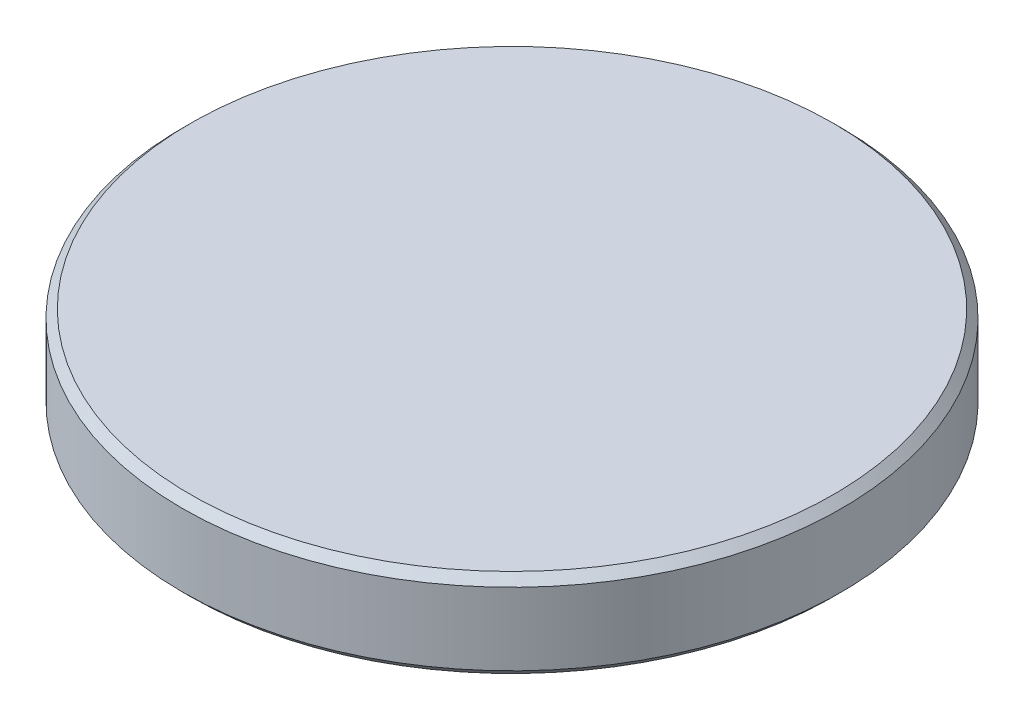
ISO-10303-21;
HEADER;
FILE_DESCRIPTION(('STEP AP214'),'2;1');
FILE_NAME('part.step','',(''),(''),'','','');
FILE_SCHEMA(('AUTOMOTIVE_DESIGN { 1 0 10303 214 1 1 1 1 }'));
ENDSEC;
DATA;
#1=APPLICATION_CONTEXT('core data for automotive mechanical design processes');
#2=APPLICATION_PROTOCOL_DEFINITION('international standard','automotive_design',2000,#1);
#3=PRODUCT_CONTEXT('',#1,'mechanical');
#4=PRODUCT('Part','Part','',(#3));
#5=PRODUCT_RELATED_PRODUCT_CATEGORY('part','',(#4));
#6=PRODUCT_DEFINITION_FORMATION('','',#4);
#7=PRODUCT_DEFINITION_CONTEXT('part definition',#1,'design');
#8=PRODUCT_DEFINITION('design','',#6,#7);
#9=PRODUCT_DEFINITION_SHAPE('','',#8);
#10=(LENGTH_UNIT() NAMED_UNIT(*) SI_UNIT(.MILLI.,.METRE.));
#11=(NAMED_UNIT(*) PLANE_ANGLE_UNIT() SI_UNIT($,.RADIAN.));
#12=(NAMED_UNIT(*) SI_UNIT($,.STERADIAN.) SOLID_ANGLE_UNIT());
#13=UNCERTAINTY_MEASURE_WITH_UNIT(LENGTH_MEASURE(1.E-05),#10,'distance_accuracy_value','');
#14=(GEOMETRIC_REPRESENTATION_CONTEXT(3) GLOBAL_UNCERTAINTY_ASSIGNED_CONTEXT((#13)) GLOBAL_UNIT_ASSIGNED_CONTEXT((#10,
#11,#12)) REPRESENTATION_CONTEXT('',''));
#15=CARTESIAN_POINT('',(0.,0.,0.));
#16=DIRECTION('',(0.,0.,1.));
#17=DIRECTION('',(1.,0.,0.));
#18=AXIS2_PLACEMENT_3D('',#15,#16,#17);
#19=CARTESIAN_POINT('',(0.,5.50000000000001,0.));
#20=DIRECTION('',(0.,-1.,0.));
#21=DIRECTION('',(0.,0.,-0.999999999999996));
#22=AXIS2_PLACEMENT_3D('',#19,#20,#21);
#23=CYLINDRICAL_SURFACE('',#22,20.5);
#24=CARTESIAN_POINT('',(0.,0.500000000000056,0.));
#25=DIRECTION('',(0.,1.,0.));
#26=DIRECTION('',(0.,0.,0.999999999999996));
#27=AXIS2_PLACEMENT_3D('',#24,#25,#26);
#28=CIRCLE('',#27,20.5);
#29=CARTESIAN_POINT('',(0.,0.500000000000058,-20.4999999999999));
#30=VERTEX_POINT('',#29);
#31=EDGE_CURVE('E41',#30,#30,#28,.T.);
#32=CARTESIAN_POINT('',(0.,5.00000000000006,0.));
#33=DIRECTION('',(0.,1.,0.));
#34=DIRECTION('',(0.,0.,0.999999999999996));
#35=AXIS2_PLACEMENT_3D('',#32,#33,#34);
#36=CIRCLE('',#35,20.5);
#37=CARTESIAN_POINT('',(0.,5.00000000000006,-20.4999999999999));
#38=VERTEX_POINT('',#37);
#39=EDGE_CURVE('E45',#38,#38,#36,.F.);
#40=CARTESIAN_POINT('',(0.,0.500000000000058,-20.4999999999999));
#41=CARTESIAN_POINT('',(0.,0.546875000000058,-20.4999999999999));
#42=CARTESIAN_POINT('',(0.,0.593750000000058,-20.4999999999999));
#43=CARTESIAN_POINT('',(0.,0.687500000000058,-20.4999999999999));
#44=CARTESIAN_POINT('',(0.,0.734375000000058,-20.4999999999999));
#45=CARTESIAN_POINT('',(0.,0.828125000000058,-20.4999999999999));
#46=CARTESIAN_POINT('',(0.,0.875000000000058,-20.4999999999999));
#47=CARTESIAN_POINT('',(0.,0.968750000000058,-20.4999999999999));
#48=CARTESIAN_POINT('',(0.,1.01562500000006,-20.4999999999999));
#49=CARTESIAN_POINT('',(0.,1.10937500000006,-20.4999999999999));
#50=CARTESIAN_POINT('',(0.,1.15625000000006,-20.4999999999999));
#51=CARTESIAN_POINT('',(0.,1.25000000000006,-20.4999999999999));
#52=CARTESIAN_POINT('',(0.,1.29687500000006,-20.4999999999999));
#53=CARTESIAN_POINT('',(0.,1.39062500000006,-20.4999999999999));
#54=CARTESIAN_POINT('',(0.,1.43750000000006,-20.4999999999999));
#55=CARTESIAN_POINT('',(0.,1.53125000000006,-20.4999999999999));
#56=CARTESIAN_POINT('',(0.,1.57812500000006,-20.4999999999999));
#57=CARTESIAN_POINT('',(0.,1.67187500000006,-20.4999999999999));
#58=CARTESIAN_POINT('',(0.,1.71875000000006,-20.4999999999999));
#59=CARTESIAN_POINT('',(0.,1.81250000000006,-20.4999999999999));
#60=CARTESIAN_POINT('',(0.,1.85937500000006,-20.4999999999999));
#61=CARTESIAN_POINT('',(0.,1.95312500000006,-20.4999999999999));
#62=CARTESIAN_POINT('',(0.,2.00000000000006,-20.4999999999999));
#63=CARTESIAN_POINT('',(0.,2.09375000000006,-20.4999999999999));
#64=CARTESIAN_POINT('',(0.,2.14062500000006,-20.4999999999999));
#65=CARTESIAN_POINT('',(0.,2.23437500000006,-20.4999999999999));
#66=CARTESIAN_POINT('',(0.,2.28125000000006,-20.4999999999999));
#67=CARTESIAN_POINT('',(0.,2.37500000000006,-20.4999999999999));
#68=CARTESIAN_POINT('',(0.,2.42187500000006,-20.4999999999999));
#69=CARTESIAN_POINT('',(0.,2.51562500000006,-20.4999999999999));
#70=CARTESIAN_POINT('',(0.,2.56250000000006,-20.4999999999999));
#71=CARTESIAN_POINT('',(0.,2.65625000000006,-20.4999999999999));
#72=CARTESIAN_POINT('',(0.,2.70312500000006,-20.4999999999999));
#73=CARTESIAN_POINT('',(0.,2.79687500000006,-20.4999999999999));
#74=CARTESIAN_POINT('',(0.,2.84375000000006,-20.4999999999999));
#75=CARTESIAN_POINT('',(0.,2.93750000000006,-20.4999999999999));
#76=CARTESIAN_POINT('',(0.,2.98437500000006,-20.4999999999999));
#77=CARTESIAN_POINT('',(0.,3.07812500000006,-20.4999999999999));
#78=CARTESIAN_POINT('',(0.,3.12500000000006,-20.4999999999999));
#79=CARTESIAN_POINT('',(0.,3.21875000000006,-20.4999999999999));
#80=CARTESIAN_POINT('',(0.,3.26562500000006,-20.4999999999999));
#81=CARTESIAN_POINT('',(0.,3.35937500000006,-20.4999999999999));
#82=CARTESIAN_POINT('',(0.,3.40625000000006,-20.4999999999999));
#83=CARTESIAN_POINT('',(0.,3.50000000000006,-20.4999999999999));
#84=CARTESIAN_POINT('',(0.,3.54687500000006,-20.4999999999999));
#85=CARTESIAN_POINT('',(0.,3.64062500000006,-20.4999999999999));
#86=CARTESIAN_POINT('',(0.,3.68750000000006,-20.4999999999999));
#87=CARTESIAN_POINT('',(0.,3.78125000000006,-20.4999999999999));
#88=CARTESIAN_POINT('',(0.,3.82812500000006,-20.4999999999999));
#89=CARTESIAN_POINT('',(0.,3.92187500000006,-20.4999999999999));
#90=CARTESIAN_POINT('',(0.,3.96875000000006,-20.4999999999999));
#91=CARTESIAN_POINT('',(0.,4.06250000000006,-20.4999999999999));
#92=CARTESIAN_POINT('',(0.,4.10937500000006,-20.4999999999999));
#93=CARTESIAN_POINT('',(0.,4.20312500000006,-20.4999999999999));
#94=CARTESIAN_POINT('',(0.,4.25000000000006,-20.4999999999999));
#95=CARTESIAN_POINT('',(0.,4.34375000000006,-20.4999999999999));
#96=CARTESIAN_POINT('',(0.,4.39062500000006,-20.4999999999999));
#97=CARTESIAN_POINT('',(0.,4.48437500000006,-20.4999999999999));
#98=CARTESIAN_POINT('',(0.,4.53125000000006,-20.4999999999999));
#99=CARTESIAN_POINT('',(0.,4.62500000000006,-20.4999999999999));
#100=CARTESIAN_POINT('',(0.,4.67187500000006,-20.4999999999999));
#101=CARTESIAN_POINT('',(0.,4.76562500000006,-20.4999999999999));
#102=CARTESIAN_POINT('',(0.,4.81250000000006,-20.4999999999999));
#103=CARTESIAN_POINT('',(0.,4.90625000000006,-20.4999999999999));
#104=CARTESIAN_POINT('',(0.,4.95312500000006,-20.4999999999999));
#105=CARTESIAN_POINT('',(0.,5.00000000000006,-20.4999999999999));
#106=B_SPLINE_CURVE_WITH_KNOTS('',3,(#40,#41,#42,#43,#44,#45,#46,#47,#48,#49,#50,#51,#52,#53,
#54,#55,#56,#57,#58,#59,#60,#61,#62,#63,#64,#65,#66,#67,#68,#69,#70,#71,#72,#73,#74,#75,#76,#77,
#78,#79,#80,#81,#82,#83,#84,#85,#86,#87,#88,#89,#90,#91,#92,#93,#94,#95,#96,#97,#98,#99,#100,
#101,#102,#103,#104,#105),.UNSPECIFIED.,.F.,.F.,(4,2,2,2,2,2,2,2,2,2,2,2,2,2,2,2,2,2,2,2,2,2,2,
2,2,2,2,2,2,2,2,2,4),(0.,0.140625,0.28125,0.421875,0.5625,0.703125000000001,0.843750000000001,
0.984375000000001,1.125,1.265625,1.40625,1.546875,1.6875,1.828125,1.96875,2.109375,2.25,
2.390625,2.53125,2.671875,2.8125,2.953125,3.09375,3.234375,3.375,3.515625,3.65625,3.796875,
3.9375,4.078125,4.21875,4.359375,4.5),.UNSPECIFIED.);
#107=EDGE_CURVE('BSEAM34',#30,#38,#106,.T.);
#108=ORIENTED_EDGE('',*,*,#31,.T.);
#109=ORIENTED_EDGE('',*,*,#39,.T.);
#110=ORIENTED_EDGE('',*,*,#107,.T.);
#111=ORIENTED_EDGE('',*,*,#107,.F.);
#112=EDGE_LOOP('',(#108,#110,#109,#111));
#113=FACE_BOUND('',#112,.T.);
#114=ADVANCED_FACE('F34',(#113),#23,.T.);
#115=CARTESIAN_POINT('',(0.,5.50000000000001,0.));
#116=DIRECTION('',(0.,1.,0.));
#117=DIRECTION('',(0.,0.,0.999999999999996));
#118=AXIS2_PLACEMENT_3D('',#115,#116,#117);
#119=PLANE('',#118);
#120=CARTESIAN_POINT('',(0.,5.50000000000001,0.));
#121=DIRECTION('',(0.,1.,0.));
#122=DIRECTION('',(0.,0.,0.999999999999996));
#123=AXIS2_PLACEMENT_3D('',#120,#121,#122);
#124=CIRCLE('',#123,20.);
#125=CARTESIAN_POINT('',(0.,5.50000000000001,-19.9999999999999));
#126=VERTEX_POINT('',#125);
#127=EDGE_CURVE('E49',#126,#126,#124,.T.);
#128=ORIENTED_EDGE('',*,*,#127,.T.);
#129=EDGE_LOOP('',(#128));
#130=FACE_BOUND('',#129,.T.);
#131=ADVANCED_FACE('F77',(#130),#119,.T.);
#132=CARTESIAN_POINT('',(0.,0.,0.));
#133=DIRECTION('',(0.,1.,0.));
#134=DIRECTION('',(0.,0.,0.999999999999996));
#135=AXIS2_PLACEMENT_3D('',#132,#133,#134);
#136=PLANE('',#135);
#137=CARTESIAN_POINT('',(0.,0.,0.));
#138=DIRECTION('',(0.,1.,0.));
#139=DIRECTION('',(0.,0.,0.999999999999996));
#140=AXIS2_PLACEMENT_3D('',#137,#138,#139);
#141=CIRCLE('',#140,20.);
#142=CARTESIAN_POINT('',(0.,0.,19.9999999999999));
#143=VERTEX_POINT('',#142);
#144=EDGE_CURVE('E10',#143,#143,#141,.F.);
#145=ORIENTED_EDGE('',*,*,#144,.T.);
#146=EDGE_LOOP('',(#145));
#147=FACE_BOUND('',#146,.T.);
#148=CARTESIAN_POINT('',(0.,0.,0.));
#149=DIRECTION('',(0.,1.,0.));
#150=DIRECTION('',(0.,0.,0.999999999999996));
#151=AXIS2_PLACEMENT_3D('',#148,#149,#150);
#152=CIRCLE('',#151,18.5);
#153=CARTESIAN_POINT('',(0.,0.,-18.4999999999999));
#154=VERTEX_POINT('',#153);
#155=EDGE_CURVE('E57',#154,#154,#152,.T.);
#156=ORIENTED_EDGE('',*,*,#155,.T.);
#157=EDGE_LOOP('',(#156));
#158=FACE_BOUND('',#157,.T.);
#159=ADVANCED_FACE('F61',(#147,#158),#136,.F.);
#160=CARTESIAN_POINT('',(0.,5.50000000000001,0.));
#161=DIRECTION('',(0.,-1.,0.));
#162=DIRECTION('',(0.,0.,-0.999999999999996));
#163=AXIS2_PLACEMENT_3D('',#160,#161,#162);
#164=CONICAL_SURFACE('',#163,20.,0.785398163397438);
#165=CARTESIAN_POINT('',(0.,5.00000000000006,-20.4999999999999));
#166=CARTESIAN_POINT('',(0.,5.0052083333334,-20.4947916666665));
#167=CARTESIAN_POINT('',(0.,5.01041666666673,-20.4895833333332));
#168=CARTESIAN_POINT('',(0.,5.02083333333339,-20.4791666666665));
#169=CARTESIAN_POINT('',(0.,5.02604166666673,-20.4739583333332));
#170=CARTESIAN_POINT('',(0.,5.03645833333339,-20.4635416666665));
#171=CARTESIAN_POINT('',(0.,5.04166666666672,-20.4583333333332));
#172=CARTESIAN_POINT('',(0.,5.05208333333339,-20.4479166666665));
#173=CARTESIAN_POINT('',(0.,5.05729166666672,-20.4427083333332));
#174=CARTESIAN_POINT('',(0.,5.06770833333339,-20.4322916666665));
#175=CARTESIAN_POINT('',(0.,5.07291666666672,-20.4270833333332));
#176=CARTESIAN_POINT('',(0.,5.08333333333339,-20.4166666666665));
#177=CARTESIAN_POINT('',(0.,5.08854166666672,-20.4114583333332));
#178=CARTESIAN_POINT('',(0.,5.09895833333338,-20.4010416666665));
#179=CARTESIAN_POINT('',(0.,5.10416666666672,-20.3958333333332));
#180=CARTESIAN_POINT('',(0.,5.11458333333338,-20.3854166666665));
#181=CARTESIAN_POINT('',(0.,5.11979166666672,-20.3802083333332));
#182=CARTESIAN_POINT('',(0.,5.13020833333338,-20.3697916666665));
#183=CARTESIAN_POINT('',(0.,5.13541666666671,-20.3645833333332));
#184=CARTESIAN_POINT('',(0.,5.14583333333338,-20.3541666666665));
#185=CARTESIAN_POINT('',(0.,5.15104166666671,-20.3489583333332));
#186=CARTESIAN_POINT('',(0.,5.16145833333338,-20.3385416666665));
#187=CARTESIAN_POINT('',(0.,5.16666666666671,-20.3333333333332));
#188=CARTESIAN_POINT('',(0.,5.17708333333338,-20.3229166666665));
#189=CARTESIAN_POINT('',(0.,5.18229166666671,-20.3177083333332));
#190=CARTESIAN_POINT('',(0.,5.19270833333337,-20.3072916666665));
#191=CARTESIAN_POINT('',(0.,5.19791666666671,-20.3020833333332));
#192=CARTESIAN_POINT('',(0.,5.20833333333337,-20.2916666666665));
#193=CARTESIAN_POINT('',(0.,5.21354166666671,-20.2864583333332));
#194=CARTESIAN_POINT('',(0.,5.22395833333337,-20.2760416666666));
#195=CARTESIAN_POINT('',(0.,5.2291666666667,-20.2708333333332));
#196=CARTESIAN_POINT('',(0.,5.23958333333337,-20.2604166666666));
#197=CARTESIAN_POINT('',(0.,5.2447916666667,-20.2552083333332));
#198=CARTESIAN_POINT('',(0.,5.25520833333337,-20.2447916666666));
#199=CARTESIAN_POINT('',(0.,5.2604166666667,-20.2395833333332));
#200=CARTESIAN_POINT('',(0.,5.27083333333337,-20.2291666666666));
#201=CARTESIAN_POINT('',(0.,5.2760416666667,-20.2239583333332));
#202=CARTESIAN_POINT('',(0.,5.28645833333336,-20.2135416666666));
#203=CARTESIAN_POINT('',(0.,5.2916666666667,-20.2083333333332));
#204=CARTESIAN_POINT('',(0.,5.30208333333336,-20.1979166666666));
#205=CARTESIAN_POINT('',(0.,5.3072916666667,-20.1927083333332));
#206=CARTESIAN_POINT('',(0.,5.31770833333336,-20.1822916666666));
#207=CARTESIAN_POINT('',(0.,5.32291666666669,-20.1770833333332));
#208=CARTESIAN_POINT('',(0.,5.33333333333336,-20.1666666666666));
#209=CARTESIAN_POINT('',(0.,5.33854166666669,-20.1614583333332));
#210=CARTESIAN_POINT('',(0.,5.34895833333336,-20.1510416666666));
#211=CARTESIAN_POINT('',(0.,5.35416666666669,-20.1458333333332));
#212=CARTESIAN_POINT('',(0.,5.36458333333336,-20.1354166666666));
#213=CARTESIAN_POINT('',(0.,5.36979166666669,-20.1302083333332));
#214=CARTESIAN_POINT('',(0.,5.38020833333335,-20.1197916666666));
#215=CARTESIAN_POINT('',(0.,5.38541666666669,-20.1145833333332));
#216=CARTESIAN_POINT('',(0.,5.39583333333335,-20.1041666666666));
#217=CARTESIAN_POINT('',(0.,5.40104166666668,-20.0989583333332));
#218=CARTESIAN_POINT('',(0.,5.41145833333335,-20.0885416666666));
#219=CARTESIAN_POINT('',(0.,5.41666666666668,-20.0833333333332));
#220=CARTESIAN_POINT('',(0.,5.42708333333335,-20.0729166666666));
#221=CARTESIAN_POINT('',(0.,5.43229166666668,-20.0677083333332));
#222=CARTESIAN_POINT('',(0.,5.44270833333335,-20.0572916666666));
#223=CARTESIAN_POINT('',(0.,5.44791666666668,-20.0520833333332));
#224=CARTESIAN_POINT('',(0.,5.45833333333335,-20.0416666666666));
#225=CARTESIAN_POINT('',(0.,5.46354166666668,-20.0364583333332));
#226=CARTESIAN_POINT('',(0.,5.47395833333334,-20.0260416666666));
#227=CARTESIAN_POINT('',(0.,5.47916666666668,-20.0208333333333));
#228=CARTESIAN_POINT('',(0.,5.48958333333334,-20.0104166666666));
#229=CARTESIAN_POINT('',(0.,5.49479166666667,-20.0052083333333));
#230=CARTESIAN_POINT('',(0.,5.50000000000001,-19.9999999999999));
#231=B_SPLINE_CURVE_WITH_KNOTS('',3,(#165,#166,#167,#168,#169,#170,#171,#172,#173,#174,#175,
#176,#177,#178,#179,#180,#181,#182,#183,#184,#185,#186,#187,#188,#189,#190,#191,#192,#193,#194,
#195,#196,#197,#198,#199,#200,#201,#202,#203,#204,#205,#206,#207,#208,#209,#210,#211,#212,#213,
#214,#215,#216,#217,#218,#219,#220,#221,#222,#223,#224,#225,#226,#227,#228,#229,#230),
.UNSPECIFIED.,.F.,.F.,(4,2,2,2,2,2,2,2,2,2,2,2,2,2,2,2,2,2,2,2,2,2,2,2,2,2,2,2,2,2,2,2,4),(0.,
0.0220970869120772,0.0441941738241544,0.0662912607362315,0.0883883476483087,0.110485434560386,
0.132582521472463,0.15467960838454,0.176776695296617,0.198873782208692,0.220970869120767,
0.243067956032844,0.265165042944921,0.287262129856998,0.309359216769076,0.331456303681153,
0.35355339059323,0.375650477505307,0.397747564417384,0.419844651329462,0.441941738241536,
0.464038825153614,0.486135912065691,0.508232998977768,0.530330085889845,0.552427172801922,
0.574524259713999,0.596621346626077,0.618718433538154,0.640815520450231,0.662912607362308,
0.685009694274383,0.707106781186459),.UNSPECIFIED.);
#232=EDGE_CURVE('BSEAM73',#38,#126,#231,.T.);
#233=ORIENTED_EDGE('',*,*,#39,.F.);
#234=ORIENTED_EDGE('',*,*,#127,.F.);
#235=ORIENTED_EDGE('',*,*,#232,.T.);
#236=ORIENTED_EDGE('',*,*,#232,.F.);
#237=EDGE_LOOP('',(#233,#235,#234,#236));
#238=FACE_BOUND('',#237,.T.);
#239=ADVANCED_FACE('F73',(#238),#164,.T.);
#240=CARTESIAN_POINT('',(0.,3.5,0.));
#241=DIRECTION('',(0.,1.,0.));
#242=DIRECTION('',(0.,0.,0.999999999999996));
#243=AXIS2_PLACEMENT_3D('',#240,#241,#242);
#244=PLANE('',#243);
#245=CARTESIAN_POINT('',(0.,3.5,0.));
#246=DIRECTION('',(0.,1.,0.));
#247=DIRECTION('',(0.,0.,0.999999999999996));
#248=AXIS2_PLACEMENT_3D('',#245,#246,#247);
#249=CIRCLE('',#248,18.5);
#250=CARTESIAN_POINT('',(0.,3.50000000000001,-18.4999999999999));
#251=VERTEX_POINT('',#250);
#252=EDGE_CURVE('E54',#251,#251,#249,.T.);
#253=ORIENTED_EDGE('',*,*,#252,.F.);
#254=EDGE_LOOP('',(#253));
#255=FACE_BOUND('',#254,.T.);
#256=ADVANCED_FACE('F65',(#255),#244,.F.);
#257=CARTESIAN_POINT('',(0.,5.50000000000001,0.));
#258=DIRECTION('',(0.,-1.,0.));
#259=DIRECTION('',(0.,0.,-0.999999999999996));
#260=AXIS2_PLACEMENT_3D('',#257,#258,#259);
#261=CYLINDRICAL_SURFACE('',#260,18.5);
#262=CARTESIAN_POINT('',(0.,3.50000000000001,-18.4999999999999));
#263=CARTESIAN_POINT('',(0.,3.46354166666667,-18.4999999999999));
#264=CARTESIAN_POINT('',(0.,3.42708333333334,-18.4999999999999));
#265=CARTESIAN_POINT('',(0.,3.35416666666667,-18.4999999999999));
#266=CARTESIAN_POINT('',(0.,3.31770833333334,-18.4999999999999));
#267=CARTESIAN_POINT('',(0.,3.24479166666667,-18.4999999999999));
#268=CARTESIAN_POINT('',(0.,3.20833333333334,-18.4999999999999));
#269=CARTESIAN_POINT('',(0.,3.13541666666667,-18.4999999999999));
#270=CARTESIAN_POINT('',(0.,3.09895833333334,-18.4999999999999));
#271=CARTESIAN_POINT('',(0.,3.02604166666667,-18.4999999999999));
#272=CARTESIAN_POINT('',(0.,2.98958333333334,-18.4999999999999));
#273=CARTESIAN_POINT('',(0.,2.91666666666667,-18.4999999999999));
#274=CARTESIAN_POINT('',(0.,2.88020833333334,-18.4999999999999));
#275=CARTESIAN_POINT('',(0.,2.80729166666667,-18.4999999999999));
#276=CARTESIAN_POINT('',(0.,2.77083333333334,-18.4999999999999));
#277=CARTESIAN_POINT('',(0.,2.69791666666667,-18.4999999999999));
#278=CARTESIAN_POINT('',(0.,2.66145833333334,-18.4999999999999));
#279=CARTESIAN_POINT('',(0.,2.58854166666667,-18.4999999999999));
#280=CARTESIAN_POINT('',(0.,2.55208333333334,-18.4999999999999));
#281=CARTESIAN_POINT('',(0.,2.47916666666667,-18.4999999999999));
#282=CARTESIAN_POINT('',(0.,2.44270833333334,-18.4999999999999));
#283=CARTESIAN_POINT('',(0.,2.36979166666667,-18.4999999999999));
#284=CARTESIAN_POINT('',(0.,2.33333333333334,-18.4999999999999));
#285=CARTESIAN_POINT('',(0.,2.26041666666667,-18.4999999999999));
#286=CARTESIAN_POINT('',(0.,2.22395833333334,-18.4999999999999));
#287=CARTESIAN_POINT('',(0.,2.15104166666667,-18.4999999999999));
#288=CARTESIAN_POINT('',(0.,2.11458333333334,-18.4999999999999));
#289=CARTESIAN_POINT('',(0.,2.04166666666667,-18.4999999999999));
#290=CARTESIAN_POINT('',(0.,2.00520833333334,-18.4999999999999));
#291=CARTESIAN_POINT('',(0.,1.93229166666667,-18.4999999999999));
#292=CARTESIAN_POINT('',(0.,1.89583333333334,-18.4999999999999));
#293=CARTESIAN_POINT('',(0.,1.82291666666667,-18.4999999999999));
#294=CARTESIAN_POINT('',(0.,1.78645833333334,-18.4999999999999));
#295=CARTESIAN_POINT('',(0.,1.71354166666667,-18.4999999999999));
#296=CARTESIAN_POINT('',(0.,1.67708333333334,-18.4999999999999));
#297=CARTESIAN_POINT('',(0.,1.60416666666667,-18.4999999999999));
#298=CARTESIAN_POINT('',(0.,1.56770833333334,-18.4999999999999));
#299=CARTESIAN_POINT('',(0.,1.49479166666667,-18.4999999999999));
#300=CARTESIAN_POINT('',(0.,1.45833333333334,-18.4999999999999));
#301=CARTESIAN_POINT('',(0.,1.38541666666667,-18.4999999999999));
#302=CARTESIAN_POINT('',(0.,1.34895833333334,-18.4999999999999));
#303=CARTESIAN_POINT('',(0.,1.27604166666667,-18.4999999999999));
#304=CARTESIAN_POINT('',(0.,1.23958333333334,-18.4999999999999));
#305=CARTESIAN_POINT('',(0.,1.16666666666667,-18.4999999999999));
#306=CARTESIAN_POINT('',(0.,1.13020833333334,-18.4999999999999));
#307=CARTESIAN_POINT('',(0.,1.05729166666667,-18.4999999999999));
#308=CARTESIAN_POINT('',(0.,1.02083333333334,-18.4999999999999));
#309=CARTESIAN_POINT('',(0.,0.94791666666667,-18.4999999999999));
#310=CARTESIAN_POINT('',(0.,0.911458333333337,-18.4999999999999));
#311=CARTESIAN_POINT('',(0.,0.83854166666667,-18.4999999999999));
#312=CARTESIAN_POINT('',(0.,0.802083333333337,-18.4999999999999));
#313=CARTESIAN_POINT('',(0.,0.72916666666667,-18.4999999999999));
#314=CARTESIAN_POINT('',(0.,0.692708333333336,-18.4999999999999));
#315=CARTESIAN_POINT('',(0.,0.61979166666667,-18.4999999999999));
#316=CARTESIAN_POINT('',(0.,0.583333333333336,-18.4999999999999));
#317=CARTESIAN_POINT('',(0.,0.51041666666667,-18.4999999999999));
#318=CARTESIAN_POINT('',(0.,0.473958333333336,-18.4999999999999));
#319=CARTESIAN_POINT('',(0.,0.40104166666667,-18.4999999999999));
#320=CARTESIAN_POINT('',(0.,0.364583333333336,-18.4999999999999));
#321=CARTESIAN_POINT('',(0.,0.29166666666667,-18.4999999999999));
#322=CARTESIAN_POINT('',(0.,0.255208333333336,-18.4999999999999));
#323=CARTESIAN_POINT('',(0.,0.182291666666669,-18.4999999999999));
#324=CARTESIAN_POINT('',(0.,0.145833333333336,-18.4999999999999));
#325=CARTESIAN_POINT('',(0.,0.0729166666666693,-18.4999999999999));
#326=CARTESIAN_POINT('',(0.,0.0364583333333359,-18.4999999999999));
#327=CARTESIAN_POINT('',(0.,0.,-18.4999999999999));
#328=B_SPLINE_CURVE_WITH_KNOTS('',3,(#262,#263,#264,#265,#266,#267,#268,#269,#270,#271,#272,
#273,#274,#275,#276,#277,#278,#279,#280,#281,#282,#283,#284,#285,#286,#287,#288,#289,#290,#291,
#292,#293,#294,#295,#296,#297,#298,#299,#300,#301,#302,#303,#304,#305,#306,#307,#308,#309,#310,
#311,#312,#313,#314,#315,#316,#317,#318,#319,#320,#321,#322,#323,#324,#325,#326,#327),
.UNSPECIFIED.,.F.,.F.,(4,2,2,2,2,2,2,2,2,2,2,2,2,2,2,2,2,2,2,2,2,2,2,2,2,2,2,2,2,2,2,2,4),(0.,
0.109375,0.21875,0.328125,0.4375,0.546875,0.656250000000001,0.765625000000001,0.875000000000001,
0.984375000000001,1.09375,1.203125,1.3125,1.421875,1.53125,1.640625,1.75,1.859375,1.96875,
2.078125,2.1875,2.296875,2.40625,2.515625,2.625,2.734375,2.84375,2.953125,3.0625,3.171875,
3.28125,3.390625,3.5),.UNSPECIFIED.);
#329=EDGE_CURVE('BSEAM63',#251,#154,#328,.T.);
#330=ORIENTED_EDGE('',*,*,#252,.T.);
#331=ORIENTED_EDGE('',*,*,#155,.F.);
#332=ORIENTED_EDGE('',*,*,#329,.T.);
#333=ORIENTED_EDGE('',*,*,#329,.F.);
#334=EDGE_LOOP('',(#330,#332,#331,#333));
#335=FACE_BOUND('',#334,.T.);
#336=ADVANCED_FACE('F63',(#335),#261,.F.);
#337=CARTESIAN_POINT('',(0.,0.500000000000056,0.));
#338=DIRECTION('',(0.,1.,0.));
#339=DIRECTION('',(0.,0.,0.999999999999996));
#340=AXIS2_PLACEMENT_3D('',#337,#338,#339);
#341=CONICAL_SURFACE('',#340,20.5,0.785398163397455);
#342=ORIENTED_EDGE('',*,*,#144,.F.);
#343=EDGE_LOOP('',(#342));
#344=FACE_BOUND('',#343,.T.);
#345=ORIENTED_EDGE('',*,*,#31,.F.);
#346=EDGE_LOOP('',(#345));
#347=FACE_BOUND('',#346,.T.);
#348=ADVANCED_FACE('F36',(#344,#347),#341,.T.);
#349=CLOSED_SHELL('',(#114,#131,#159,#239,#256,#336,#348));
#350=MANIFOLD_SOLID_BREP('B2',#349);
#351=ADVANCED_BREP_SHAPE_REPRESENTATION('',(#18,#350),#14);
#352=SHAPE_DEFINITION_REPRESENTATION(#9,#351);
ENDSEC;
END-ISO-10303-21;
